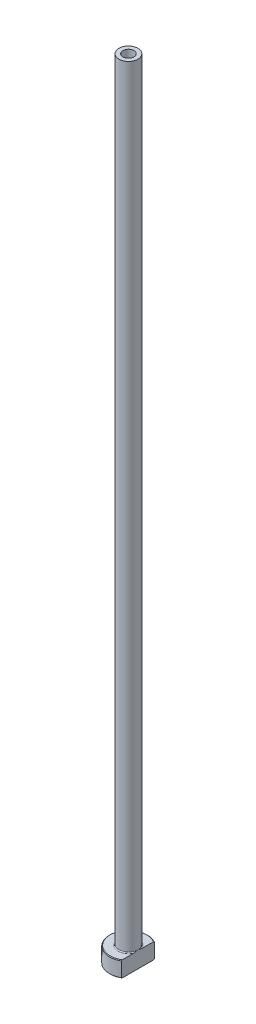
from build123d import *

# Parameters (mm, degrees)
FILLET1_R          = 0.3
CHAMFER1_SIZE      = 0.2
CUT_EXTRUDE1_DEPTH = 251.143958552
CHAMFER2_SIZE      = 0.5


with BuildPart() as part:
    # Sketch1 → Revolve1 (revolve)
    with BuildSketch(Plane.XY, mode=Mode.PRIVATE) as revolve1_sk:
        Polygon((-1.75, 250), (-3, 250), (-3, 5), (-6, 5), (-6, 0), (-2, 0), (-2, 193), (-1.75, 205), align=None)
    revolve(revolve1_sk.sketch.rotate(Axis((0, 92.187680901, 0), (0, -1, 0)), 270), axis=Axis((0, 92.187680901, 0), (0, -1, 0)))

    # Fillet1
    fillet1_edges = [part.edges().sort_by_distance(p)[0] for p in [
        (0, 5, -3),
    ]]
    fillet(fillet1_edges, radius=FILLET1_R)

    # Chamfer1
    chamfer1_edges = [part.edges().sort_by_distance(p)[0] for p in [
        (0, 0, -6),
        (0, 5, -6),
    ]]
    chamfer(chamfer1_edges, length=CHAMFER1_SIZE)

    # Sketch2 → Cut-Extrude1 (cut, through all)
    with BuildSketch(Plane.XZ):
        with BuildLine():
            Line((3, 5.196152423), (3, -5.196152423))
            ThreePointArc((3, -5.196152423), (6, 0), (3, 5.196152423))
        make_face()
    extrude(amount=-CUT_EXTRUDE1_DEPTH, mode=Mode.SUBTRACT)

    # Chamfer2
    chamfer2_edges = [part.edges().sort_by_distance(p)[0] for p in [
        (0, 0, -2),
    ]]
    chamfer(chamfer2_edges, length=CHAMFER2_SIZE)


solid = part.part
